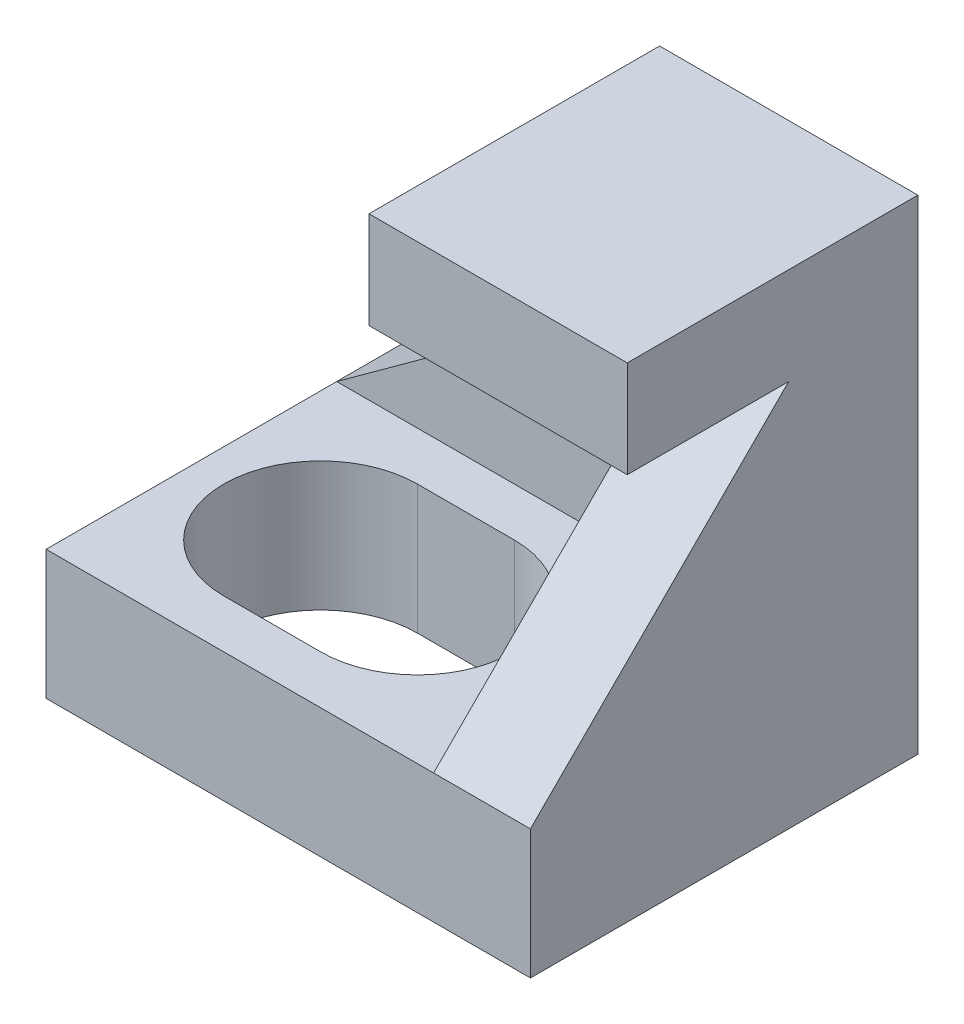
ISO-10303-21;
HEADER;
FILE_DESCRIPTION(('STEP AP214'),'2;1');
FILE_NAME('part.step','',(''),(''),'','','');
FILE_SCHEMA(('AUTOMOTIVE_DESIGN { 1 0 10303 214 1 1 1 1 }'));
ENDSEC;
DATA;
#1=APPLICATION_CONTEXT('core data for automotive mechanical design processes');
#2=APPLICATION_PROTOCOL_DEFINITION('international standard','automotive_design',2000,#1);
#3=PRODUCT_CONTEXT('',#1,'mechanical');
#4=PRODUCT('Part','Part','',(#3));
#5=PRODUCT_RELATED_PRODUCT_CATEGORY('part','',(#4));
#6=PRODUCT_DEFINITION_FORMATION('','',#4);
#7=PRODUCT_DEFINITION_CONTEXT('part definition',#1,'design');
#8=PRODUCT_DEFINITION('design','',#6,#7);
#9=PRODUCT_DEFINITION_SHAPE('','',#8);
#10=(LENGTH_UNIT() NAMED_UNIT(*) SI_UNIT(.MILLI.,.METRE.));
#11=(NAMED_UNIT(*) PLANE_ANGLE_UNIT() SI_UNIT($,.RADIAN.));
#12=(NAMED_UNIT(*) SI_UNIT($,.STERADIAN.) SOLID_ANGLE_UNIT());
#13=UNCERTAINTY_MEASURE_WITH_UNIT(LENGTH_MEASURE(1.E-05),#10,'distance_accuracy_value','');
#14=(GEOMETRIC_REPRESENTATION_CONTEXT(3) GLOBAL_UNCERTAINTY_ASSIGNED_CONTEXT((#13)) GLOBAL_UNIT_ASSIGNED_CONTEXT((#10,
#11,#12)) REPRESENTATION_CONTEXT('',''));
#15=CARTESIAN_POINT('',(0.,0.,0.));
#16=DIRECTION('',(0.,0.,1.));
#17=DIRECTION('',(1.,0.,0.));
#18=AXIS2_PLACEMENT_3D('',#15,#16,#17);
#19=CARTESIAN_POINT('',(0.,20.,-60.));
#20=DIRECTION('',(0.,-1.,0.));
#21=DIRECTION('',(0.,0.,-1.));
#22=AXIS2_PLACEMENT_3D('',#19,#20,#21);
#23=PLANE('',#22);
#24=DIRECTION('',(1.,0.,0.));
#25=VECTOR('',#24,1.);
#26=CARTESIAN_POINT('',(20.,20.,-7.5));
#27=LINE('',#26,#25);
#28=CARTESIAN_POINT('',(20.,20.,-7.5));
#29=VERTEX_POINT('',#28);
#30=CARTESIAN_POINT('',(35.,20.,-7.5));
#31=VERTEX_POINT('',#30);
#32=EDGE_CURVE('E167',#29,#31,#27,.T.);
#33=ORIENTED_EDGE('',*,*,#32,.F.);
#34=CARTESIAN_POINT('',(20.,20.,-22.5));
#35=DIRECTION('',(0.,1.,0.));
#36=DIRECTION('',(0.,0.,-1.));
#37=AXIS2_PLACEMENT_3D('',#34,#35,#36);
#38=CIRCLE('',#37,15.);
#39=CARTESIAN_POINT('',(20.,20.,-37.5));
#40=VERTEX_POINT('',#39);
#41=EDGE_CURVE('E48',#40,#29,#38,.T.);
#42=ORIENTED_EDGE('',*,*,#41,.F.);
#43=DIRECTION('',(-1.,0.,0.));
#44=VECTOR('',#43,1.);
#45=CARTESIAN_POINT('',(20.,20.,-37.5));
#46=LINE('',#45,#44);
#47=CARTESIAN_POINT('',(35.,20.,-37.5));
#48=VERTEX_POINT('',#47);
#49=EDGE_CURVE('E158',#48,#40,#46,.T.);
#50=ORIENTED_EDGE('',*,*,#49,.F.);
#51=CARTESIAN_POINT('',(35.,20.,-22.5));
#52=DIRECTION('',(0.,1.,0.));
#53=DIRECTION('',(0.,0.,1.));
#54=AXIS2_PLACEMENT_3D('',#51,#52,#53);
#55=CIRCLE('',#54,15.);
#56=EDGE_CURVE('E161',#31,#48,#55,.T.);
#57=ORIENTED_EDGE('',*,*,#56,.F.);
#58=EDGE_LOOP('',(#33,#42,#50,#57));
#59=FACE_BOUND('',#58,.T.);
#60=DIRECTION('',(0.,0.,-1.));
#61=VECTOR('',#60,1.);
#62=CARTESIAN_POINT('',(60.,20.,-60.));
#63=LINE('',#62,#61);
#64=CARTESIAN_POINT('',(60.,20.,0.));
#65=VERTEX_POINT('',#64);
#66=CARTESIAN_POINT('',(60.,20.,-45.));
#67=VERTEX_POINT('',#66);
#68=EDGE_CURVE('E203',#65,#67,#63,.T.);
#69=ORIENTED_EDGE('',*,*,#68,.T.);
#70=DIRECTION('',(-1.,0.,0.));
#71=VECTOR('',#70,1.);
#72=CARTESIAN_POINT('',(75.,20.,-45.));
#73=LINE('',#72,#71);
#74=CARTESIAN_POINT('',(0.,20.,-45.));
#75=VERTEX_POINT('',#74);
#76=EDGE_CURVE('E233',#67,#75,#73,.T.);
#77=ORIENTED_EDGE('',*,*,#76,.T.);
#78=DIRECTION('',(0.,0.,1.));
#79=VECTOR('',#78,1.);
#80=CARTESIAN_POINT('',(0.,20.,0.));
#81=LINE('',#80,#79);
#82=CARTESIAN_POINT('',(0.,20.,0.));
#83=VERTEX_POINT('',#82);
#84=EDGE_CURVE('E289',#75,#83,#81,.T.);
#85=ORIENTED_EDGE('',*,*,#84,.T.);
#86=DIRECTION('',(1.,0.,0.));
#87=VECTOR('',#86,1.);
#88=CARTESIAN_POINT('',(0.,20.,0.));
#89=LINE('',#88,#87);
#90=EDGE_CURVE('E295',#83,#65,#89,.T.);
#91=ORIENTED_EDGE('',*,*,#90,.T.);
#92=EDGE_LOOP('',(#69,#77,#85,#91));
#93=FACE_BOUND('',#92,.T.);
#94=ADVANCED_FACE('F31',(#59,#93),#23,.F.);
#95=CARTESIAN_POINT('',(75.,20.,-45.));
#96=DIRECTION('',(0.,0.,1.));
#97=DIRECTION('',(1.,0.,0.));
#98=AXIS2_PLACEMENT_3D('',#95,#96,#97);
#99=PLANE('',#98);
#100=ORIENTED_EDGE('',*,*,#76,.F.);
#101=DIRECTION('',(0.,1.,0.));
#102=VECTOR('',#101,1.);
#103=CARTESIAN_POINT('',(60.,20.,-45.));
#104=LINE('',#103,#102);
#105=CARTESIAN_POINT('',(60.,60.,-45.));
#106=VERTEX_POINT('',#105);
#107=EDGE_CURVE('E11',#67,#106,#104,.T.);
#108=ORIENTED_EDGE('',*,*,#107,.T.);
#109=DIRECTION('',(1.,0.,0.));
#110=VECTOR('',#109,1.);
#111=CARTESIAN_POINT('',(55.,60.,-45.));
#112=LINE('',#111,#110);
#113=CARTESIAN_POINT('',(55.,60.,-45.));
#114=VERTEX_POINT('',#113);
#115=EDGE_CURVE('E230',#114,#106,#112,.T.);
#116=ORIENTED_EDGE('',*,*,#115,.F.);
#117=DIRECTION('',(0.808736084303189,0.588171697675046,0.));
#118=VECTOR('',#117,1.);
#119=CARTESIAN_POINT('',(0.,20.,-45.));
#120=LINE('',#119,#118);
#121=EDGE_CURVE('E237',#75,#114,#120,.T.);
#122=ORIENTED_EDGE('',*,*,#121,.F.);
#123=EDGE_LOOP('',(#100,#108,#116,#122));
#124=FACE_BOUND('',#123,.T.);
#125=ADVANCED_FACE('F319',(#124),#99,.T.);
#126=CARTESIAN_POINT('',(0.,20.,0.));
#127=DIRECTION('',(1.,0.,0.));
#128=DIRECTION('',(0.,0.,-1.));
#129=AXIS2_PLACEMENT_3D('',#126,#127,#128);
#130=PLANE('',#129);
#131=DIRECTION('',(0.,0.,1.));
#132=VECTOR('',#131,1.);
#133=CARTESIAN_POINT('',(0.,0.,0.));
#134=LINE('',#133,#132);
#135=CARTESIAN_POINT('',(0.,0.,-60.));
#136=VERTEX_POINT('',#135);
#137=CARTESIAN_POINT('',(0.,0.,0.));
#138=VERTEX_POINT('',#137);
#139=EDGE_CURVE('E229',#136,#138,#134,.T.);
#140=ORIENTED_EDGE('',*,*,#139,.T.);
#141=DIRECTION('',(0.,-1.,0.));
#142=VECTOR('',#141,1.);
#143=CARTESIAN_POINT('',(0.,20.,0.));
#144=LINE('',#143,#142);
#145=EDGE_CURVE('E40',#83,#138,#144,.T.);
#146=ORIENTED_EDGE('',*,*,#145,.F.);
#147=ORIENTED_EDGE('',*,*,#84,.F.);
#148=CARTESIAN_POINT('',(0.,20.,-60.));
#149=VERTEX_POINT('',#148);
#150=EDGE_CURVE('E291',#149,#75,#81,.T.);
#151=ORIENTED_EDGE('',*,*,#150,.F.);
#152=DIRECTION('',(0.,-1.,0.));
#153=VECTOR('',#152,1.);
#154=CARTESIAN_POINT('',(0.,20.,-60.));
#155=LINE('',#154,#153);
#156=EDGE_CURVE('E281',#149,#136,#155,.T.);
#157=ORIENTED_EDGE('',*,*,#156,.T.);
#158=EDGE_LOOP('',(#140,#146,#147,#151,#157));
#159=FACE_BOUND('',#158,.T.);
#160=ADVANCED_FACE('F33',(#159),#130,.F.);
#161=CARTESIAN_POINT('',(0.,20.,0.));
#162=DIRECTION('',(0.,0.,-1.));
#163=DIRECTION('',(-1.,0.,0.));
#164=AXIS2_PLACEMENT_3D('',#161,#162,#163);
#165=PLANE('',#164);
#166=DIRECTION('',(1.,0.,0.));
#167=VECTOR('',#166,1.);
#168=CARTESIAN_POINT('',(0.,0.,0.));
#169=LINE('',#168,#167);
#170=CARTESIAN_POINT('',(75.,0.,0.));
#171=VERTEX_POINT('',#170);
#172=EDGE_CURVE('E285',#138,#171,#169,.T.);
#173=ORIENTED_EDGE('',*,*,#172,.T.);
#174=DIRECTION('',(0.,-1.,0.));
#175=VECTOR('',#174,1.);
#176=CARTESIAN_POINT('',(75.,20.,0.));
#177=LINE('',#176,#175);
#178=CARTESIAN_POINT('',(75.,20.,0.));
#179=VERTEX_POINT('',#178);
#180=EDGE_CURVE('E280',#179,#171,#177,.T.);
#181=ORIENTED_EDGE('',*,*,#180,.F.);
#182=DIRECTION('',(1.,0.,0.));
#183=VECTOR('',#182,1.);
#184=CARTESIAN_POINT('',(60.,20.,0.));
#185=LINE('',#184,#183);
#186=EDGE_CURVE('E214',#65,#179,#185,.T.);
#187=ORIENTED_EDGE('',*,*,#186,.F.);
#188=ORIENTED_EDGE('',*,*,#90,.F.);
#189=ORIENTED_EDGE('',*,*,#145,.T.);
#190=EDGE_LOOP('',(#173,#181,#187,#188,#189));
#191=FACE_BOUND('',#190,.T.);
#192=ADVANCED_FACE('F307',(#191),#165,.F.);
#193=CARTESIAN_POINT('',(75.,20.,0.));
#194=DIRECTION('',(-1.,0.,0.));
#195=DIRECTION('',(0.,0.,1.));
#196=AXIS2_PLACEMENT_3D('',#193,#194,#195);
#197=PLANE('',#196);
#198=DIRECTION('',(0.,0.,-1.));
#199=VECTOR('',#198,1.);
#200=CARTESIAN_POINT('',(75.,0.,0.));
#201=LINE('',#200,#199);
#202=CARTESIAN_POINT('',(75.,0.,-60.));
#203=VERTEX_POINT('',#202);
#204=EDGE_CURVE('E284',#171,#203,#201,.T.);
#205=ORIENTED_EDGE('',*,*,#204,.T.);
#206=DIRECTION('',(0.,-1.,0.));
#207=VECTOR('',#206,1.);
#208=CARTESIAN_POINT('',(75.,20.,-60.));
#209=LINE('',#208,#207);
#210=CARTESIAN_POINT('',(75.,75.,-60.));
#211=VERTEX_POINT('',#210);
#212=EDGE_CURVE('E273',#211,#203,#209,.T.);
#213=ORIENTED_EDGE('',*,*,#212,.F.);
#214=DIRECTION('',(0.,0.,-1.));
#215=VECTOR('',#214,1.);
#216=CARTESIAN_POINT('',(75.,75.,-60.));
#217=LINE('',#216,#215);
#218=CARTESIAN_POINT('',(75.,75.,-15.));
#219=VERTEX_POINT('',#218);
#220=EDGE_CURVE('E183',#219,#211,#217,.T.);
#221=ORIENTED_EDGE('',*,*,#220,.F.);
#222=DIRECTION('',(0.,-1.,0.));
#223=VECTOR('',#222,1.);
#224=CARTESIAN_POINT('',(75.,75.,-15.));
#225=LINE('',#224,#223);
#226=CARTESIAN_POINT('',(75.,60.,-15.));
#227=VERTEX_POINT('',#226);
#228=EDGE_CURVE('E252',#219,#227,#225,.T.);
#229=ORIENTED_EDGE('',*,*,#228,.T.);
#230=DIRECTION('',(0.,0.,-1.));
#231=VECTOR('',#230,1.);
#232=CARTESIAN_POINT('',(75.,60.,-60.));
#233=LINE('',#232,#231);
#234=CARTESIAN_POINT('',(75.,60.,-40.));
#235=VERTEX_POINT('',#234);
#236=EDGE_CURVE('E193',#227,#235,#233,.T.);
#237=ORIENTED_EDGE('',*,*,#236,.T.);
#238=DIRECTION('',(0.,-0.707106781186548,0.707106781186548));
#239=VECTOR('',#238,1.);
#240=CARTESIAN_POINT('',(75.,20.,0.));
#241=LINE('',#240,#239);
#242=EDGE_CURVE('E207',#235,#179,#241,.T.);
#243=ORIENTED_EDGE('',*,*,#242,.T.);
#244=ORIENTED_EDGE('',*,*,#180,.T.);
#245=EDGE_LOOP('',(#205,#213,#221,#229,#237,#243,#244));
#246=FACE_BOUND('',#245,.T.);
#247=ADVANCED_FACE('F272',(#246),#197,.F.);
#248=CARTESIAN_POINT('',(0.,20.,-60.));
#249=DIRECTION('',(0.,0.,1.));
#250=DIRECTION('',(1.,0.,0.));
#251=AXIS2_PLACEMENT_3D('',#248,#249,#250);
#252=PLANE('',#251);
#253=ORIENTED_EDGE('',*,*,#212,.T.);
#254=DIRECTION('',(-1.,0.,0.));
#255=VECTOR('',#254,1.);
#256=CARTESIAN_POINT('',(0.,0.,-60.));
#257=LINE('',#256,#255);
#258=EDGE_CURVE('E278',#203,#136,#257,.T.);
#259=ORIENTED_EDGE('',*,*,#258,.T.);
#260=ORIENTED_EDGE('',*,*,#156,.F.);
#261=DIRECTION('',(0.808736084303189,0.588171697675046,0.));
#262=VECTOR('',#261,1.);
#263=CARTESIAN_POINT('',(0.,20.,-60.));
#264=LINE('',#263,#262);
#265=CARTESIAN_POINT('',(55.,60.,-60.));
#266=VERTEX_POINT('',#265);
#267=EDGE_CURVE('E216',#149,#266,#264,.T.);
#268=ORIENTED_EDGE('',*,*,#267,.T.);
#269=DIRECTION('',(-1.,0.,0.));
#270=VECTOR('',#269,1.);
#271=CARTESIAN_POINT('',(35.,60.,-60.));
#272=LINE('',#271,#270);
#273=CARTESIAN_POINT('',(35.,60.,-60.));
#274=VERTEX_POINT('',#273);
#275=EDGE_CURVE('E181',#266,#274,#272,.T.);
#276=ORIENTED_EDGE('',*,*,#275,.T.);
#277=DIRECTION('',(0.,-1.,0.));
#278=VECTOR('',#277,1.);
#279=CARTESIAN_POINT('',(35.,75.,-60.));
#280=LINE('',#279,#278);
#281=CARTESIAN_POINT('',(35.,75.,-60.));
#282=VERTEX_POINT('',#281);
#283=EDGE_CURVE('E188',#282,#274,#280,.T.);
#284=ORIENTED_EDGE('',*,*,#283,.F.);
#285=DIRECTION('',(-1.,0.,0.));
#286=VECTOR('',#285,1.);
#287=CARTESIAN_POINT('',(35.,75.,-60.));
#288=LINE('',#287,#286);
#289=EDGE_CURVE('E186',#211,#282,#288,.T.);
#290=ORIENTED_EDGE('',*,*,#289,.F.);
#291=EDGE_LOOP('',(#253,#259,#260,#268,#276,#284,#290));
#292=FACE_BOUND('',#291,.T.);
#293=ADVANCED_FACE('F276',(#292),#252,.F.);
#294=CARTESIAN_POINT('',(0.,0.,-60.));
#295=DIRECTION('',(0.,-1.,0.));
#296=DIRECTION('',(0.,0.,-1.));
#297=AXIS2_PLACEMENT_3D('',#294,#295,#296);
#298=PLANE('',#297);
#299=CARTESIAN_POINT('',(20.,0.,-22.5));
#300=DIRECTION('',(0.,1.,0.));
#301=DIRECTION('',(0.,0.,-1.));
#302=AXIS2_PLACEMENT_3D('',#299,#300,#301);
#303=CIRCLE('',#302,15.);
#304=CARTESIAN_POINT('',(20.,0.,-37.5));
#305=VERTEX_POINT('',#304);
#306=CARTESIAN_POINT('',(20.,0.,-7.5));
#307=VERTEX_POINT('',#306);
#308=EDGE_CURVE('E142',#305,#307,#303,.T.);
#309=ORIENTED_EDGE('',*,*,#308,.T.);
#310=DIRECTION('',(1.,0.,0.));
#311=VECTOR('',#310,1.);
#312=CARTESIAN_POINT('',(20.,0.,-7.5));
#313=LINE('',#312,#311);
#314=CARTESIAN_POINT('',(35.,0.,-7.5));
#315=VERTEX_POINT('',#314);
#316=EDGE_CURVE('E151',#307,#315,#313,.T.);
#317=ORIENTED_EDGE('',*,*,#316,.T.);
#318=CARTESIAN_POINT('',(35.,0.,-22.5));
#319=DIRECTION('',(0.,1.,0.));
#320=DIRECTION('',(0.,0.,1.));
#321=AXIS2_PLACEMENT_3D('',#318,#319,#320);
#322=CIRCLE('',#321,15.);
#323=CARTESIAN_POINT('',(35.,0.,-37.5));
#324=VERTEX_POINT('',#323);
#325=EDGE_CURVE('E56',#315,#324,#322,.T.);
#326=ORIENTED_EDGE('',*,*,#325,.T.);
#327=DIRECTION('',(-1.,0.,0.));
#328=VECTOR('',#327,1.);
#329=CARTESIAN_POINT('',(20.,0.,-37.5));
#330=LINE('',#329,#328);
#331=EDGE_CURVE('E148',#324,#305,#330,.T.);
#332=ORIENTED_EDGE('',*,*,#331,.T.);
#333=EDGE_LOOP('',(#309,#317,#326,#332));
#334=FACE_BOUND('',#333,.T.);
#335=ORIENTED_EDGE('',*,*,#139,.F.);
#336=ORIENTED_EDGE('',*,*,#258,.F.);
#337=ORIENTED_EDGE('',*,*,#204,.F.);
#338=ORIENTED_EDGE('',*,*,#172,.F.);
#339=EDGE_LOOP('',(#335,#336,#337,#338));
#340=FACE_BOUND('',#339,.T.);
#341=ADVANCED_FACE('F155',(#334,#340),#298,.T.);
#342=CARTESIAN_POINT('',(0.,20.,-45.));
#343=DIRECTION('',(-0.588171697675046,0.808736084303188,0.));
#344=DIRECTION('',(-0.808736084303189,-0.588171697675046,0.));
#345=AXIS2_PLACEMENT_3D('',#342,#343,#344);
#346=PLANE('',#345);
#347=ORIENTED_EDGE('',*,*,#267,.F.);
#348=ORIENTED_EDGE('',*,*,#150,.T.);
#349=ORIENTED_EDGE('',*,*,#121,.T.);
#350=DIRECTION('',(0.,0.,-1.));
#351=VECTOR('',#350,1.);
#352=CARTESIAN_POINT('',(55.,60.,-45.));
#353=LINE('',#352,#351);
#354=EDGE_CURVE('E227',#114,#266,#353,.T.);
#355=ORIENTED_EDGE('',*,*,#354,.T.);
#356=EDGE_LOOP('',(#347,#348,#349,#355));
#357=FACE_BOUND('',#356,.T.);
#358=ADVANCED_FACE('F316',(#357),#346,.T.);
#359=CARTESIAN_POINT('',(60.,20.,0.));
#360=DIRECTION('',(0.,0.707106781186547,0.707106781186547));
#361=DIRECTION('',(0.,-0.707106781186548,0.707106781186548));
#362=AXIS2_PLACEMENT_3D('',#359,#360,#361);
#363=PLANE('',#362);
#364=ORIENTED_EDGE('',*,*,#242,.F.);
#365=DIRECTION('',(1.,0.,0.));
#366=VECTOR('',#365,1.);
#367=CARTESIAN_POINT('',(60.,60.,-40.));
#368=LINE('',#367,#366);
#369=CARTESIAN_POINT('',(60.,60.,-40.));
#370=VERTEX_POINT('',#369);
#371=EDGE_CURVE('E213',#370,#235,#368,.T.);
#372=ORIENTED_EDGE('',*,*,#371,.F.);
#373=DIRECTION('',(0.,-0.707106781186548,0.707106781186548));
#374=VECTOR('',#373,1.);
#375=CARTESIAN_POINT('',(60.,20.,0.));
#376=LINE('',#375,#374);
#377=EDGE_CURVE('E210',#370,#65,#376,.T.);
#378=ORIENTED_EDGE('',*,*,#377,.T.);
#379=ORIENTED_EDGE('',*,*,#186,.T.);
#380=EDGE_LOOP('',(#364,#372,#378,#379));
#381=FACE_BOUND('',#380,.T.);
#382=ADVANCED_FACE('F375',(#381),#363,.T.);
#383=CARTESIAN_POINT('',(60.,20.,-60.));
#384=DIRECTION('',(1.,0.,0.));
#385=DIRECTION('',(0.,0.,-1.));
#386=AXIS2_PLACEMENT_3D('',#383,#384,#385);
#387=PLANE('',#386);
#388=ORIENTED_EDGE('',*,*,#107,.F.);
#389=ORIENTED_EDGE('',*,*,#68,.F.);
#390=ORIENTED_EDGE('',*,*,#377,.F.);
#391=DIRECTION('',(0.,0.,1.));
#392=VECTOR('',#391,1.);
#393=CARTESIAN_POINT('',(60.,60.,-40.));
#394=LINE('',#393,#392);
#395=EDGE_CURVE('E206',#106,#370,#394,.T.);
#396=ORIENTED_EDGE('',*,*,#395,.F.);
#397=EDGE_LOOP('',(#388,#389,#390,#396));
#398=FACE_BOUND('',#397,.T.);
#399=ADVANCED_FACE('F321',(#398),#387,.F.);
#400=CARTESIAN_POINT('',(35.,75.,-60.));
#401=DIRECTION('',(1.,0.,0.));
#402=DIRECTION('',(0.,1.,0.));
#403=AXIS2_PLACEMENT_3D('',#400,#401,#402);
#404=PLANE('',#403);
#405=DIRECTION('',(0.,0.,1.));
#406=VECTOR('',#405,1.);
#407=CARTESIAN_POINT('',(35.,60.,-60.));
#408=LINE('',#407,#406);
#409=CARTESIAN_POINT('',(35.,60.,-15.));
#410=VERTEX_POINT('',#409);
#411=EDGE_CURVE('E173',#274,#410,#408,.T.);
#412=ORIENTED_EDGE('',*,*,#411,.T.);
#413=DIRECTION('',(0.,-1.,0.));
#414=VECTOR('',#413,1.);
#415=CARTESIAN_POINT('',(35.,75.,-15.));
#416=LINE('',#415,#414);
#417=CARTESIAN_POINT('',(35.,75.,-15.));
#418=VERTEX_POINT('',#417);
#419=EDGE_CURVE('E247',#418,#410,#416,.T.);
#420=ORIENTED_EDGE('',*,*,#419,.F.);
#421=DIRECTION('',(0.,0.,1.));
#422=VECTOR('',#421,1.);
#423=CARTESIAN_POINT('',(35.,75.,-60.));
#424=LINE('',#423,#422);
#425=EDGE_CURVE('E177',#282,#418,#424,.T.);
#426=ORIENTED_EDGE('',*,*,#425,.F.);
#427=ORIENTED_EDGE('',*,*,#283,.T.);
#428=EDGE_LOOP('',(#412,#420,#426,#427));
#429=FACE_BOUND('',#428,.T.);
#430=ADVANCED_FACE('F262',(#429),#404,.F.);
#431=CARTESIAN_POINT('',(35.,75.,-15.));
#432=DIRECTION('',(0.,0.,-1.));
#433=DIRECTION('',(-1.,0.,0.));
#434=AXIS2_PLACEMENT_3D('',#431,#432,#433);
#435=PLANE('',#434);
#436=DIRECTION('',(1.,0.,0.));
#437=VECTOR('',#436,1.);
#438=CARTESIAN_POINT('',(35.,60.,-15.));
#439=LINE('',#438,#437);
#440=EDGE_CURVE('E191',#410,#227,#439,.T.);
#441=ORIENTED_EDGE('',*,*,#440,.T.);
#442=ORIENTED_EDGE('',*,*,#228,.F.);
#443=DIRECTION('',(1.,0.,0.));
#444=VECTOR('',#443,1.);
#445=CARTESIAN_POINT('',(35.,75.,-15.));
#446=LINE('',#445,#444);
#447=EDGE_CURVE('E180',#418,#219,#446,.T.);
#448=ORIENTED_EDGE('',*,*,#447,.F.);
#449=ORIENTED_EDGE('',*,*,#419,.T.);
#450=EDGE_LOOP('',(#441,#442,#448,#449));
#451=FACE_BOUND('',#450,.T.);
#452=ADVANCED_FACE('F269',(#451),#435,.F.);
#453=CARTESIAN_POINT('',(35.,75.,-15.));
#454=DIRECTION('',(0.,1.,0.));
#455=DIRECTION('',(-1.,0.,0.));
#456=AXIS2_PLACEMENT_3D('',#453,#454,#455);
#457=PLANE('',#456);
#458=ORIENTED_EDGE('',*,*,#425,.T.);
#459=ORIENTED_EDGE('',*,*,#447,.T.);
#460=ORIENTED_EDGE('',*,*,#220,.T.);
#461=ORIENTED_EDGE('',*,*,#289,.T.);
#462=EDGE_LOOP('',(#458,#459,#460,#461));
#463=FACE_BOUND('',#462,.T.);
#464=ADVANCED_FACE('F275',(#463),#457,.T.);
#465=CARTESIAN_POINT('',(35.,60.,-15.));
#466=DIRECTION('',(0.,1.,0.));
#467=DIRECTION('',(-1.,0.,0.));
#468=AXIS2_PLACEMENT_3D('',#465,#466,#467);
#469=PLANE('',#468);
#470=ORIENTED_EDGE('',*,*,#354,.F.);
#471=ORIENTED_EDGE('',*,*,#115,.T.);
#472=ORIENTED_EDGE('',*,*,#395,.T.);
#473=ORIENTED_EDGE('',*,*,#371,.T.);
#474=ORIENTED_EDGE('',*,*,#236,.F.);
#475=ORIENTED_EDGE('',*,*,#440,.F.);
#476=ORIENTED_EDGE('',*,*,#411,.F.);
#477=ORIENTED_EDGE('',*,*,#275,.F.);
#478=EDGE_LOOP('',(#470,#471,#472,#473,#474,#475,#476,#477));
#479=FACE_BOUND('',#478,.T.);
#480=ADVANCED_FACE('F266',(#479),#469,.F.);
#481=CARTESIAN_POINT('',(20.,0.,-22.5));
#482=DIRECTION('',(0.,1.,0.));
#483=DIRECTION('',(0.,0.,1.));
#484=AXIS2_PLACEMENT_3D('',#481,#482,#483);
#485=CYLINDRICAL_SURFACE('',#484,15.);
#486=ORIENTED_EDGE('',*,*,#41,.T.);
#487=DIRECTION('',(0.,1.,0.));
#488=VECTOR('',#487,1.);
#489=CARTESIAN_POINT('',(20.,0.,-7.5));
#490=LINE('',#489,#488);
#491=EDGE_CURVE('E138',#307,#29,#490,.T.);
#492=ORIENTED_EDGE('',*,*,#491,.F.);
#493=ORIENTED_EDGE('',*,*,#308,.F.);
#494=DIRECTION('',(0.,1.,0.));
#495=VECTOR('',#494,1.);
#496=CARTESIAN_POINT('',(20.,0.,-37.5));
#497=LINE('',#496,#495);
#498=EDGE_CURVE('E171',#305,#40,#497,.T.);
#499=ORIENTED_EDGE('',*,*,#498,.T.);
#500=EDGE_LOOP('',(#486,#492,#493,#499));
#501=FACE_BOUND('',#500,.T.);
#502=ADVANCED_FACE('F140',(#501),#485,.F.);
#503=CARTESIAN_POINT('',(20.,0.,-37.5));
#504=DIRECTION('',(0.,0.,-1.));
#505=DIRECTION('',(-1.,0.,0.));
#506=AXIS2_PLACEMENT_3D('',#503,#504,#505);
#507=PLANE('',#506);
#508=ORIENTED_EDGE('',*,*,#49,.T.);
#509=ORIENTED_EDGE('',*,*,#498,.F.);
#510=ORIENTED_EDGE('',*,*,#331,.F.);
#511=DIRECTION('',(0.,1.,0.));
#512=VECTOR('',#511,1.);
#513=CARTESIAN_POINT('',(35.,0.,-37.5));
#514=LINE('',#513,#512);
#515=EDGE_CURVE('E174',#324,#48,#514,.T.);
#516=ORIENTED_EDGE('',*,*,#515,.T.);
#517=EDGE_LOOP('',(#508,#509,#510,#516));
#518=FACE_BOUND('',#517,.T.);
#519=ADVANCED_FACE('F441',(#518),#507,.F.);
#520=CARTESIAN_POINT('',(35.,0.,-22.5));
#521=DIRECTION('',(0.,1.,0.));
#522=DIRECTION('',(0.,0.,1.));
#523=AXIS2_PLACEMENT_3D('',#520,#521,#522);
#524=CYLINDRICAL_SURFACE('',#523,15.);
#525=ORIENTED_EDGE('',*,*,#56,.T.);
#526=ORIENTED_EDGE('',*,*,#515,.F.);
#527=ORIENTED_EDGE('',*,*,#325,.F.);
#528=DIRECTION('',(0.,1.,0.));
#529=VECTOR('',#528,1.);
#530=CARTESIAN_POINT('',(35.,0.,-7.5));
#531=LINE('',#530,#529);
#532=EDGE_CURVE('E147',#315,#31,#531,.T.);
#533=ORIENTED_EDGE('',*,*,#532,.T.);
#534=EDGE_LOOP('',(#525,#526,#527,#533));
#535=FACE_BOUND('',#534,.T.);
#536=ADVANCED_FACE('F450',(#535),#524,.F.);
#537=CARTESIAN_POINT('',(20.,0.,-7.5));
#538=DIRECTION('',(0.,0.,1.));
#539=DIRECTION('',(1.,0.,0.));
#540=AXIS2_PLACEMENT_3D('',#537,#538,#539);
#541=PLANE('',#540);
#542=ORIENTED_EDGE('',*,*,#32,.T.);
#543=ORIENTED_EDGE('',*,*,#532,.F.);
#544=ORIENTED_EDGE('',*,*,#316,.F.);
#545=ORIENTED_EDGE('',*,*,#491,.T.);
#546=EDGE_LOOP('',(#542,#543,#544,#545));
#547=FACE_BOUND('',#546,.T.);
#548=ADVANCED_FACE('F152',(#547),#541,.F.);
#549=CLOSED_SHELL('',(#94,#125,#160,#192,#247,#293,#341,#358,#382,#399,#430,#452,#464,#480,#502,
#519,#536,#548));
#550=MANIFOLD_SOLID_BREP('B2',#549);
#551=ADVANCED_BREP_SHAPE_REPRESENTATION('',(#18,#550),#14);
#552=SHAPE_DEFINITION_REPRESENTATION(#9,#551);
ENDSEC;
END-ISO-10303-21;
